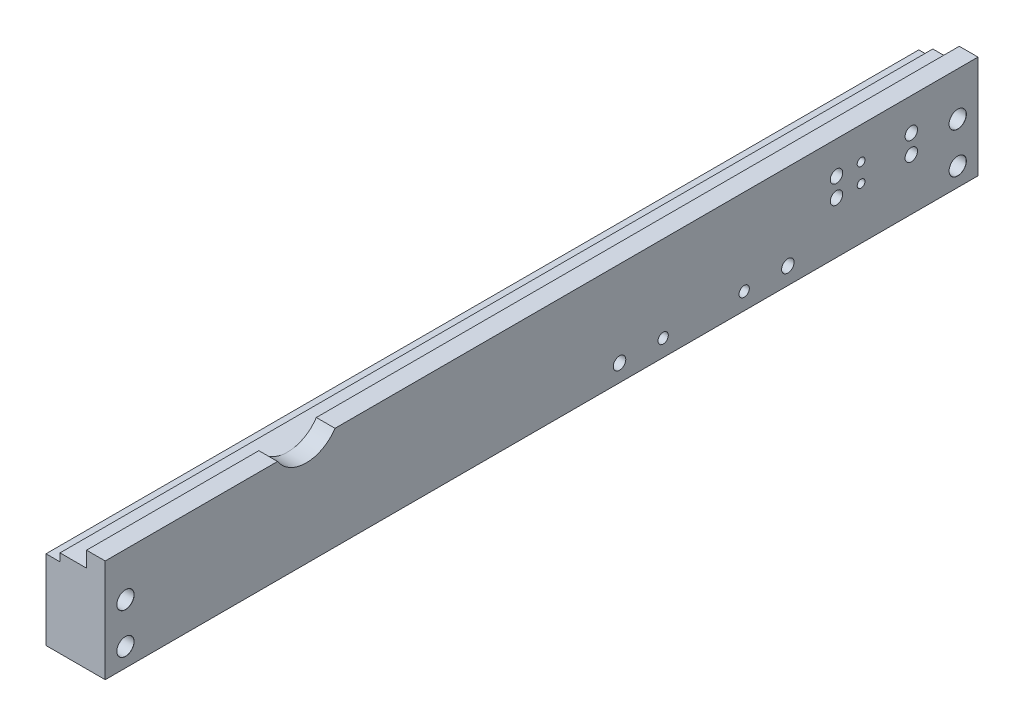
ISO-10303-21;
HEADER;
FILE_DESCRIPTION(('STEP AP214'),'2;1');
FILE_NAME('part.step','',(''),(''),'','','');
FILE_SCHEMA(('AUTOMOTIVE_DESIGN { 1 0 10303 214 1 1 1 1 }'));
ENDSEC;
DATA;
#1=APPLICATION_CONTEXT('core data for automotive mechanical design processes');
#2=APPLICATION_PROTOCOL_DEFINITION('international standard','automotive_design',2000,#1);
#3=PRODUCT_CONTEXT('',#1,'mechanical');
#4=PRODUCT('Part','Part','',(#3));
#5=PRODUCT_RELATED_PRODUCT_CATEGORY('part','',(#4));
#6=PRODUCT_DEFINITION_FORMATION('','',#4);
#7=PRODUCT_DEFINITION_CONTEXT('part definition',#1,'design');
#8=PRODUCT_DEFINITION('design','',#6,#7);
#9=PRODUCT_DEFINITION_SHAPE('','',#8);
#10=(LENGTH_UNIT() NAMED_UNIT(*) SI_UNIT(.MILLI.,.METRE.));
#11=(NAMED_UNIT(*) PLANE_ANGLE_UNIT() SI_UNIT($,.RADIAN.));
#12=(NAMED_UNIT(*) SI_UNIT($,.STERADIAN.) SOLID_ANGLE_UNIT());
#13=UNCERTAINTY_MEASURE_WITH_UNIT(LENGTH_MEASURE(1.E-05),#10,'distance_accuracy_value','');
#14=(GEOMETRIC_REPRESENTATION_CONTEXT(3) GLOBAL_UNCERTAINTY_ASSIGNED_CONTEXT((#13)) GLOBAL_UNIT_ASSIGNED_CONTEXT((#10,
#11,#12)) REPRESENTATION_CONTEXT('',''));
#15=CARTESIAN_POINT('',(0.,0.,0.));
#16=DIRECTION('',(0.,0.,1.));
#17=DIRECTION('',(1.,0.,0.));
#18=AXIS2_PLACEMENT_3D('',#15,#16,#17);
#19=CARTESIAN_POINT('',(-159.,251.054588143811,-280.));
#20=DIRECTION('',(0.,-1.,0.));
#21=DIRECTION('',(0.,0.,1.));
#22=AXIS2_PLACEMENT_3D('',#19,#20,#21);
#23=PLANE('',#22);
#24=DIRECTION('',(0.,0.,1.));
#25=VECTOR('',#24,1.);
#26=CARTESIAN_POINT('',(-165.,251.054588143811,-280.));
#27=LINE('',#26,#25);
#28=CARTESIAN_POINT('',(-165.,251.054588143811,-55.2804555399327));
#29=VERTEX_POINT('',#28);
#30=CARTESIAN_POINT('',(-165.,251.054588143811,0.));
#31=VERTEX_POINT('',#30);
#32=EDGE_CURVE('E164',#29,#31,#27,.T.);
#33=ORIENTED_EDGE('',*,*,#32,.T.);
#34=DIRECTION('',(-1.,0.,0.));
#35=VECTOR('',#34,1.);
#36=CARTESIAN_POINT('',(-159.,251.054588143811,0.));
#37=LINE('',#36,#35);
#38=CARTESIAN_POINT('',(-159.,251.054588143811,0.));
#39=VERTEX_POINT('',#38);
#40=EDGE_CURVE('E146',#39,#31,#37,.T.);
#41=ORIENTED_EDGE('',*,*,#40,.F.);
#42=DIRECTION('',(0.,0.,1.));
#43=VECTOR('',#42,1.);
#44=CARTESIAN_POINT('',(-159.,251.054588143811,-280.));
#45=LINE('',#44,#43);
#46=CARTESIAN_POINT('',(-159.,251.054588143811,-55.2804555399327));
#47=VERTEX_POINT('',#46);
#48=EDGE_CURVE('E24',#47,#39,#45,.T.);
#49=ORIENTED_EDGE('',*,*,#48,.F.);
#50=DIRECTION('',(1.,0.,0.));
#51=VECTOR('',#50,1.);
#52=CARTESIAN_POINT('',(-178.,251.054588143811,-55.2804555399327));
#53=LINE('',#52,#51);
#54=EDGE_CURVE('E110',#29,#47,#53,.T.);
#55=ORIENTED_EDGE('',*,*,#54,.F.);
#56=EDGE_LOOP('',(#33,#41,#49,#55));
#57=FACE_BOUND('',#56,.T.);
#58=ADVANCED_FACE('F16',(#57),#23,.F.);
#59=CARTESIAN_POINT('',(-165.,251.054588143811,-280.));
#60=DIRECTION('',(1.,0.,0.));
#61=DIRECTION('',(0.,0.,1.));
#62=AXIS2_PLACEMENT_3D('',#59,#60,#61);
#63=PLANE('',#62);
#64=CARTESIAN_POINT('',(-165.,251.054588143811,-280.));
#65=VERTEX_POINT('',#64);
#66=CARTESIAN_POINT('',(-165.,251.054588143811,-73.7195444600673));
#67=VERTEX_POINT('',#66);
#68=EDGE_CURVE('E103',#65,#67,#27,.T.);
#69=ORIENTED_EDGE('',*,*,#68,.F.);
#70=DIRECTION('',(0.,-1.,0.));
#71=VECTOR('',#70,1.);
#72=CARTESIAN_POINT('',(-165.,251.054588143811,-280.));
#73=LINE('',#72,#71);
#74=CARTESIAN_POINT('',(-165.,246.05458814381,-280.));
#75=VERTEX_POINT('',#74);
#76=EDGE_CURVE('E126',#65,#75,#73,.T.);
#77=ORIENTED_EDGE('',*,*,#76,.T.);
#78=DIRECTION('',(0.,0.,-1.));
#79=VECTOR('',#78,1.);
#80=CARTESIAN_POINT('',(-165.,246.05458814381,0.));
#81=LINE('',#80,#79);
#82=CARTESIAN_POINT('',(-165.,246.054588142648,-64.5));
#83=VERTEX_POINT('',#82);
#84=EDGE_CURVE('E200',#83,#75,#81,.T.);
#85=ORIENTED_EDGE('',*,*,#84,.F.);
#86=CARTESIAN_POINT('',(-165.,257.054588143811,-64.5));
#87=DIRECTION('',(-1.,0.,0.));
#88=DIRECTION('',(0.,0.,1.));
#89=AXIS2_PLACEMENT_3D('',#86,#87,#88);
#90=CIRCLE('',#89,11.0000000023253);
#91=EDGE_CURVE('E106',#67,#83,#90,.T.);
#92=ORIENTED_EDGE('',*,*,#91,.F.);
#93=EDGE_LOOP('',(#69,#77,#85,#92));
#94=FACE_BOUND('',#93,.T.);
#95=ADVANCED_FACE('F362',(#94),#63,.F.);
#96=CARTESIAN_POINT('',(-159.,218.05458814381,-280.));
#97=DIRECTION('',(-1.,0.,0.));
#98=DIRECTION('',(0.,0.,-1.));
#99=AXIS2_PLACEMENT_3D('',#96,#97,#98);
#100=PLANE('',#99);
#101=CARTESIAN_POINT('',(-159.,223.46553223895,-178.994628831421));
#102=DIRECTION('',(1.,0.,0.));
#103=DIRECTION('',(0.,0.,-1.));
#104=AXIS2_PLACEMENT_3D('',#101,#102,#103);
#105=CIRCLE('',#104,1.65);
#106=CARTESIAN_POINT('',(-159.,223.46553223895,-180.644628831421));
#107=VERTEX_POINT('',#106);
#108=EDGE_CURVE('E339',#107,#107,#105,.T.);
#109=ORIENTED_EDGE('',*,*,#108,.F.);
#110=EDGE_LOOP('',(#109));
#111=FACE_BOUND('',#110,.T.);
#112=CARTESIAN_POINT('',(-159.,223.46553223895,-204.994628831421));
#113=DIRECTION('',(1.,0.,0.));
#114=DIRECTION('',(0.,0.,-1.));
#115=AXIS2_PLACEMENT_3D('',#112,#113,#114);
#116=CIRCLE('',#115,1.65);
#117=CARTESIAN_POINT('',(-159.,223.46553223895,-206.644628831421));
#118=VERTEX_POINT('',#117);
#119=EDGE_CURVE('E333',#118,#118,#116,.T.);
#120=ORIENTED_EDGE('',*,*,#119,.F.);
#121=EDGE_LOOP('',(#120));
#122=FACE_BOUND('',#121,.T.);
#123=CARTESIAN_POINT('',(-159.,234.65458814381,-234.6));
#124=DIRECTION('',(1.,0.,0.));
#125=DIRECTION('',(0.,0.,-1.));
#126=AXIS2_PLACEMENT_3D('',#123,#124,#125);
#127=CIRCLE('',#126,2.);
#128=CARTESIAN_POINT('',(-159.,234.65458814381,-236.6));
#129=VERTEX_POINT('',#128);
#130=EDGE_CURVE('E327',#129,#129,#127,.T.);
#131=ORIENTED_EDGE('',*,*,#130,.F.);
#132=EDGE_LOOP('',(#131));
#133=FACE_BOUND('',#132,.T.);
#134=CARTESIAN_POINT('',(-159.,240.65458814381,-234.6));
#135=DIRECTION('',(1.,0.,0.));
#136=DIRECTION('',(0.,0.,-1.));
#137=AXIS2_PLACEMENT_3D('',#134,#135,#136);
#138=CIRCLE('',#137,2.);
#139=CARTESIAN_POINT('',(-159.,240.65458814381,-236.6));
#140=VERTEX_POINT('',#139);
#141=EDGE_CURVE('E321',#140,#140,#138,.T.);
#142=ORIENTED_EDGE('',*,*,#141,.F.);
#143=EDGE_LOOP('',(#142));
#144=FACE_BOUND('',#143,.T.);
#145=CARTESIAN_POINT('',(-159.,234.65458814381,-258.6));
#146=DIRECTION('',(1.,0.,0.));
#147=DIRECTION('',(0.,0.,-1.));
#148=AXIS2_PLACEMENT_3D('',#145,#146,#147);
#149=CIRCLE('',#148,2.);
#150=CARTESIAN_POINT('',(-159.,234.65458814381,-260.6));
#151=VERTEX_POINT('',#150);
#152=EDGE_CURVE('E315',#151,#151,#149,.T.);
#153=ORIENTED_EDGE('',*,*,#152,.F.);
#154=EDGE_LOOP('',(#153));
#155=FACE_BOUND('',#154,.T.);
#156=CARTESIAN_POINT('',(-159.,240.65458814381,-258.6));
#157=DIRECTION('',(1.,0.,0.));
#158=DIRECTION('',(0.,0.,-1.));
#159=AXIS2_PLACEMENT_3D('',#156,#157,#158);
#160=CIRCLE('',#159,2.);
#161=CARTESIAN_POINT('',(-159.,240.65458814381,-260.6));
#162=VERTEX_POINT('',#161);
#163=EDGE_CURVE('E309',#162,#162,#160,.T.);
#164=ORIENTED_EDGE('',*,*,#163,.F.);
#165=EDGE_LOOP('',(#164));
#166=FACE_BOUND('',#165,.T.);
#167=CARTESIAN_POINT('',(-159.,223.55458814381,-219.));
#168=DIRECTION('',(1.,0.,0.));
#169=DIRECTION('',(0.,0.,-1.));
#170=AXIS2_PLACEMENT_3D('',#167,#168,#169);
#171=CIRCLE('',#170,2.);
#172=CARTESIAN_POINT('',(-159.,223.55458814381,-221.));
#173=VERTEX_POINT('',#172);
#174=EDGE_CURVE('E303',#173,#173,#171,.T.);
#175=ORIENTED_EDGE('',*,*,#174,.F.);
#176=EDGE_LOOP('',(#175));
#177=FACE_BOUND('',#176,.T.);
#178=CARTESIAN_POINT('',(-159.,223.55458814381,-165.));
#179=DIRECTION('',(1.,0.,0.));
#180=DIRECTION('',(0.,0.,-1.));
#181=AXIS2_PLACEMENT_3D('',#178,#179,#180);
#182=CIRCLE('',#181,2.);
#183=CARTESIAN_POINT('',(-159.,223.55458814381,-167.));
#184=VERTEX_POINT('',#183);
#185=EDGE_CURVE('E297',#184,#184,#182,.T.);
#186=ORIENTED_EDGE('',*,*,#185,.F.);
#187=EDGE_LOOP('',(#186));
#188=FACE_BOUND('',#187,.T.);
#189=CARTESIAN_POINT('',(-159.,234.65458814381,-242.5));
#190=DIRECTION('',(1.,0.,0.));
#191=DIRECTION('',(0.,0.,-1.));
#192=AXIS2_PLACEMENT_3D('',#189,#190,#191);
#193=CIRCLE('',#192,1.25);
#194=CARTESIAN_POINT('',(-159.,234.65458814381,-243.75));
#195=VERTEX_POINT('',#194);
#196=EDGE_CURVE('E291',#195,#195,#193,.T.);
#197=ORIENTED_EDGE('',*,*,#196,.F.);
#198=EDGE_LOOP('',(#197));
#199=FACE_BOUND('',#198,.T.);
#200=CARTESIAN_POINT('',(-159.,240.65458814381,-242.5));
#201=DIRECTION('',(1.,0.,0.));
#202=DIRECTION('',(0.,0.,-1.));
#203=AXIS2_PLACEMENT_3D('',#200,#201,#202);
#204=CIRCLE('',#203,1.25);
#205=CARTESIAN_POINT('',(-159.,240.65458814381,-243.75));
#206=VERTEX_POINT('',#205);
#207=EDGE_CURVE('E114',#206,#206,#204,.T.);
#208=ORIENTED_EDGE('',*,*,#207,.F.);
#209=EDGE_LOOP('',(#208));
#210=FACE_BOUND('',#209,.T.);
#211=CARTESIAN_POINT('',(-159.,224.05458814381,-273.5));
#212=DIRECTION('',(1.,0.,0.));
#213=DIRECTION('',(0.,0.,-1.));
#214=AXIS2_PLACEMENT_3D('',#211,#212,#213);
#215=CIRCLE('',#214,2.775);
#216=CARTESIAN_POINT('',(-159.,224.05458814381,-276.275));
#217=VERTEX_POINT('',#216);
#218=EDGE_CURVE('E105',#217,#217,#215,.T.);
#219=ORIENTED_EDGE('',*,*,#218,.F.);
#220=EDGE_LOOP('',(#219));
#221=FACE_BOUND('',#220,.T.);
#222=CARTESIAN_POINT('',(-159.,237.05458814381,-273.5));
#223=DIRECTION('',(1.,0.,0.));
#224=DIRECTION('',(0.,0.,-1.));
#225=AXIS2_PLACEMENT_3D('',#222,#223,#224);
#226=CIRCLE('',#225,2.775);
#227=CARTESIAN_POINT('',(-159.,237.05458814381,-276.275));
#228=VERTEX_POINT('',#227);
#229=EDGE_CURVE('E261',#228,#228,#226,.T.);
#230=ORIENTED_EDGE('',*,*,#229,.F.);
#231=EDGE_LOOP('',(#230));
#232=FACE_BOUND('',#231,.T.);
#233=CARTESIAN_POINT('',(-159.,224.05458814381,-6.5));
#234=DIRECTION('',(1.,0.,0.));
#235=DIRECTION('',(0.,0.,-1.));
#236=AXIS2_PLACEMENT_3D('',#233,#234,#235);
#237=CIRCLE('',#236,2.775);
#238=CARTESIAN_POINT('',(-159.,224.05458814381,-9.275));
#239=VERTEX_POINT('',#238);
#240=EDGE_CURVE('E240',#239,#239,#237,.T.);
#241=ORIENTED_EDGE('',*,*,#240,.F.);
#242=EDGE_LOOP('',(#241));
#243=FACE_BOUND('',#242,.T.);
#244=CARTESIAN_POINT('',(-159.,237.05458814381,-6.5));
#245=DIRECTION('',(1.,0.,0.));
#246=DIRECTION('',(0.,0.,-1.));
#247=AXIS2_PLACEMENT_3D('',#244,#245,#246);
#248=CIRCLE('',#247,2.775);
#249=CARTESIAN_POINT('',(-159.,237.05458814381,-9.275));
#250=VERTEX_POINT('',#249);
#251=EDGE_CURVE('E219',#250,#250,#248,.T.);
#252=ORIENTED_EDGE('',*,*,#251,.F.);
#253=EDGE_LOOP('',(#252));
#254=FACE_BOUND('',#253,.T.);
#255=ORIENTED_EDGE('',*,*,#48,.T.);
#256=DIRECTION('',(0.,1.,0.));
#257=VECTOR('',#256,1.);
#258=CARTESIAN_POINT('',(-159.,218.05458814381,0.));
#259=LINE('',#258,#257);
#260=CARTESIAN_POINT('',(-159.,218.05458814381,0.));
#261=VERTEX_POINT('',#260);
#262=EDGE_CURVE('E144',#261,#39,#259,.T.);
#263=ORIENTED_EDGE('',*,*,#262,.F.);
#264=DIRECTION('',(0.,0.,1.));
#265=VECTOR('',#264,1.);
#266=CARTESIAN_POINT('',(-159.,218.05458814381,-280.));
#267=LINE('',#266,#265);
#268=CARTESIAN_POINT('',(-159.,218.05458814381,-280.));
#269=VERTEX_POINT('',#268);
#270=EDGE_CURVE('E121',#269,#261,#267,.T.);
#271=ORIENTED_EDGE('',*,*,#270,.F.);
#272=DIRECTION('',(0.,1.,0.));
#273=VECTOR('',#272,1.);
#274=CARTESIAN_POINT('',(-159.,218.05458814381,-280.));
#275=LINE('',#274,#273);
#276=CARTESIAN_POINT('',(-159.,251.054588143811,-280.));
#277=VERTEX_POINT('',#276);
#278=EDGE_CURVE('E118',#269,#277,#275,.T.);
#279=ORIENTED_EDGE('',*,*,#278,.T.);
#280=CARTESIAN_POINT('',(-159.,251.054588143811,-73.7195444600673));
#281=VERTEX_POINT('',#280);
#282=EDGE_CURVE('E11',#277,#281,#45,.T.);
#283=ORIENTED_EDGE('',*,*,#282,.T.);
#284=CARTESIAN_POINT('',(-159.,257.054588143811,-64.5));
#285=DIRECTION('',(-1.,0.,0.));
#286=DIRECTION('',(0.,0.,1.));
#287=AXIS2_PLACEMENT_3D('',#284,#285,#286);
#288=CIRCLE('',#287,11.0000000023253);
#289=EDGE_CURVE('E108',#281,#47,#288,.T.);
#290=ORIENTED_EDGE('',*,*,#289,.T.);
#291=EDGE_LOOP('',(#255,#263,#271,#279,#283,#290));
#292=FACE_BOUND('',#291,.T.);
#293=ADVANCED_FACE('F18',(#111,#122,#133,#144,#155,#166,#177,#188,#199,#210,#221,#232,#243,#254,
#292),#100,.F.);
#294=ORIENTED_EDGE('',*,*,#282,.F.);
#295=DIRECTION('',(-1.,0.,0.));
#296=VECTOR('',#295,1.);
#297=CARTESIAN_POINT('',(-159.,251.054588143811,-280.));
#298=LINE('',#297,#296);
#299=EDGE_CURVE('E123',#277,#65,#298,.T.);
#300=ORIENTED_EDGE('',*,*,#299,.T.);
#301=ORIENTED_EDGE('',*,*,#68,.T.);
#302=DIRECTION('',(1.,0.,0.));
#303=VECTOR('',#302,1.);
#304=CARTESIAN_POINT('',(-178.,251.054588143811,-73.7195444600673));
#305=LINE('',#304,#303);
#306=EDGE_CURVE('E98',#281,#67,#305,.F.);
#307=ORIENTED_EDGE('',*,*,#306,.F.);
#308=EDGE_LOOP('',(#294,#300,#301,#307));
#309=FACE_BOUND('',#308,.T.);
#310=ADVANCED_FACE('F100',(#309),#23,.F.);
#311=CARTESIAN_POINT('',(-165.,246.05458814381,0.));
#312=VERTEX_POINT('',#311);
#313=EDGE_CURVE('E131',#312,#83,#81,.T.);
#314=ORIENTED_EDGE('',*,*,#313,.F.);
#315=DIRECTION('',(0.,-1.,0.));
#316=VECTOR('',#315,1.);
#317=CARTESIAN_POINT('',(-165.,251.054588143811,0.));
#318=LINE('',#317,#316);
#319=EDGE_CURVE('E150',#31,#312,#318,.T.);
#320=ORIENTED_EDGE('',*,*,#319,.F.);
#321=ORIENTED_EDGE('',*,*,#32,.F.);
#322=EDGE_CURVE('E31',#83,#29,#90,.T.);
#323=ORIENTED_EDGE('',*,*,#322,.F.);
#324=EDGE_LOOP('',(#314,#320,#321,#323));
#325=FACE_BOUND('',#324,.T.);
#326=ADVANCED_FACE('F171',(#325),#63,.F.);
#327=CARTESIAN_POINT('',(-178.,243.55458814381,-280.));
#328=DIRECTION('',(0.,-1.,0.));
#329=DIRECTION('',(0.,0.,1.));
#330=AXIS2_PLACEMENT_3D('',#327,#328,#329);
#331=PLANE('',#330);
#332=DIRECTION('',(-1.,0.,0.));
#333=VECTOR('',#332,1.);
#334=CARTESIAN_POINT('',(-178.,243.55458814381,-280.));
#335=LINE('',#334,#333);
#336=CARTESIAN_POINT('',(-173.5,243.55458814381,-280.));
#337=VERTEX_POINT('',#336);
#338=CARTESIAN_POINT('',(-178.,243.55458814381,-280.));
#339=VERTEX_POINT('',#338);
#340=EDGE_CURVE('E136',#337,#339,#335,.T.);
#341=ORIENTED_EDGE('',*,*,#340,.T.);
#342=DIRECTION('',(0.,0.,1.));
#343=VECTOR('',#342,1.);
#344=CARTESIAN_POINT('',(-178.,243.55458814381,-280.));
#345=LINE('',#344,#343);
#346=CARTESIAN_POINT('',(-178.,243.55458814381,0.));
#347=VERTEX_POINT('',#346);
#348=EDGE_CURVE('E162',#339,#347,#345,.T.);
#349=ORIENTED_EDGE('',*,*,#348,.T.);
#350=DIRECTION('',(-1.,0.,0.));
#351=VECTOR('',#350,1.);
#352=CARTESIAN_POINT('',(-178.,243.55458814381,0.));
#353=LINE('',#352,#351);
#354=CARTESIAN_POINT('',(-173.5,243.55458814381,0.));
#355=VERTEX_POINT('',#354);
#356=EDGE_CURVE('E153',#355,#347,#353,.T.);
#357=ORIENTED_EDGE('',*,*,#356,.F.);
#358=DIRECTION('',(0.,0.,-1.));
#359=VECTOR('',#358,1.);
#360=CARTESIAN_POINT('',(-173.5,243.55458814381,0.));
#361=LINE('',#360,#359);
#362=EDGE_CURVE('E147',#355,#337,#361,.T.);
#363=ORIENTED_EDGE('',*,*,#362,.T.);
#364=EDGE_LOOP('',(#341,#349,#357,#363));
#365=FACE_BOUND('',#364,.T.);
#366=ADVANCED_FACE('F187',(#365),#331,.F.);
#367=CARTESIAN_POINT('',(-178.,218.05458814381,-280.));
#368=DIRECTION('',(1.,0.,0.));
#369=DIRECTION('',(0.,0.,1.));
#370=AXIS2_PLACEMENT_3D('',#367,#368,#369);
#371=PLANE('',#370);
#372=CARTESIAN_POINT('',(-178.,223.46553223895,-178.994628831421));
#373=DIRECTION('',(1.,0.,0.));
#374=DIRECTION('',(0.,0.,-1.));
#375=AXIS2_PLACEMENT_3D('',#372,#373,#374);
#376=CIRCLE('',#375,1.65);
#377=CARTESIAN_POINT('',(-178.,223.46553223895,-180.644628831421));
#378=VERTEX_POINT('',#377);
#379=EDGE_CURVE('E342',#378,#378,#376,.T.);
#380=ORIENTED_EDGE('',*,*,#379,.T.);
#381=EDGE_LOOP('',(#380));
#382=FACE_BOUND('',#381,.T.);
#383=CARTESIAN_POINT('',(-178.,223.46553223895,-204.994628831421));
#384=DIRECTION('',(1.,0.,0.));
#385=DIRECTION('',(0.,0.,-1.));
#386=AXIS2_PLACEMENT_3D('',#383,#384,#385);
#387=CIRCLE('',#386,1.65);
#388=CARTESIAN_POINT('',(-178.,223.46553223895,-206.644628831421));
#389=VERTEX_POINT('',#388);
#390=EDGE_CURVE('E336',#389,#389,#387,.T.);
#391=ORIENTED_EDGE('',*,*,#390,.T.);
#392=EDGE_LOOP('',(#391));
#393=FACE_BOUND('',#392,.T.);
#394=CARTESIAN_POINT('',(-178.,234.65458814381,-234.6));
#395=DIRECTION('',(1.,0.,0.));
#396=DIRECTION('',(0.,0.,-1.));
#397=AXIS2_PLACEMENT_3D('',#394,#395,#396);
#398=CIRCLE('',#397,2.);
#399=CARTESIAN_POINT('',(-178.,234.65458814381,-236.6));
#400=VERTEX_POINT('',#399);
#401=EDGE_CURVE('E330',#400,#400,#398,.T.);
#402=ORIENTED_EDGE('',*,*,#401,.T.);
#403=EDGE_LOOP('',(#402));
#404=FACE_BOUND('',#403,.T.);
#405=CARTESIAN_POINT('',(-178.,240.65458814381,-234.6));
#406=DIRECTION('',(1.,0.,0.));
#407=DIRECTION('',(0.,0.,-1.));
#408=AXIS2_PLACEMENT_3D('',#405,#406,#407);
#409=CIRCLE('',#408,2.);
#410=CARTESIAN_POINT('',(-178.,240.65458814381,-236.6));
#411=VERTEX_POINT('',#410);
#412=EDGE_CURVE('E324',#411,#411,#409,.T.);
#413=ORIENTED_EDGE('',*,*,#412,.T.);
#414=EDGE_LOOP('',(#413));
#415=FACE_BOUND('',#414,.T.);
#416=CARTESIAN_POINT('',(-178.,234.65458814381,-258.6));
#417=DIRECTION('',(1.,0.,0.));
#418=DIRECTION('',(0.,0.,-1.));
#419=AXIS2_PLACEMENT_3D('',#416,#417,#418);
#420=CIRCLE('',#419,2.);
#421=CARTESIAN_POINT('',(-178.,234.65458814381,-260.6));
#422=VERTEX_POINT('',#421);
#423=EDGE_CURVE('E318',#422,#422,#420,.T.);
#424=ORIENTED_EDGE('',*,*,#423,.T.);
#425=EDGE_LOOP('',(#424));
#426=FACE_BOUND('',#425,.T.);
#427=CARTESIAN_POINT('',(-178.,240.65458814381,-258.6));
#428=DIRECTION('',(1.,0.,0.));
#429=DIRECTION('',(0.,0.,-1.));
#430=AXIS2_PLACEMENT_3D('',#427,#428,#429);
#431=CIRCLE('',#430,1.99999999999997);
#432=CARTESIAN_POINT('',(-178.,240.65458814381,-260.6));
#433=VERTEX_POINT('',#432);
#434=EDGE_CURVE('E312',#433,#433,#431,.T.);
#435=ORIENTED_EDGE('',*,*,#434,.T.);
#436=EDGE_LOOP('',(#435));
#437=FACE_BOUND('',#436,.T.);
#438=CARTESIAN_POINT('',(-178.,223.55458814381,-219.));
#439=DIRECTION('',(1.,0.,0.));
#440=DIRECTION('',(0.,0.,-1.));
#441=AXIS2_PLACEMENT_3D('',#438,#439,#440);
#442=CIRCLE('',#441,2.);
#443=CARTESIAN_POINT('',(-178.,223.55458814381,-221.));
#444=VERTEX_POINT('',#443);
#445=EDGE_CURVE('E306',#444,#444,#442,.T.);
#446=ORIENTED_EDGE('',*,*,#445,.T.);
#447=EDGE_LOOP('',(#446));
#448=FACE_BOUND('',#447,.T.);
#449=CARTESIAN_POINT('',(-178.,223.55458814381,-165.));
#450=DIRECTION('',(1.,0.,0.));
#451=DIRECTION('',(0.,0.,-1.));
#452=AXIS2_PLACEMENT_3D('',#449,#450,#451);
#453=CIRCLE('',#452,2.);
#454=CARTESIAN_POINT('',(-178.,223.55458814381,-167.));
#455=VERTEX_POINT('',#454);
#456=EDGE_CURVE('E300',#455,#455,#453,.T.);
#457=ORIENTED_EDGE('',*,*,#456,.T.);
#458=EDGE_LOOP('',(#457));
#459=FACE_BOUND('',#458,.T.);
#460=CARTESIAN_POINT('',(-178.,234.65458814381,-242.5));
#461=DIRECTION('',(1.,0.,0.));
#462=DIRECTION('',(0.,0.,-1.));
#463=AXIS2_PLACEMENT_3D('',#460,#461,#462);
#464=CIRCLE('',#463,1.24999999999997);
#465=CARTESIAN_POINT('',(-178.,234.65458814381,-243.75));
#466=VERTEX_POINT('',#465);
#467=EDGE_CURVE('E294',#466,#466,#464,.T.);
#468=ORIENTED_EDGE('',*,*,#467,.T.);
#469=EDGE_LOOP('',(#468));
#470=FACE_BOUND('',#469,.T.);
#471=CARTESIAN_POINT('',(-178.,240.65458814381,-242.5));
#472=DIRECTION('',(1.,0.,0.));
#473=DIRECTION('',(0.,0.,-1.));
#474=AXIS2_PLACEMENT_3D('',#471,#472,#473);
#475=CIRCLE('',#474,1.24999999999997);
#476=CARTESIAN_POINT('',(-178.,240.65458814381,-243.75));
#477=VERTEX_POINT('',#476);
#478=EDGE_CURVE('E288',#477,#477,#475,.T.);
#479=ORIENTED_EDGE('',*,*,#478,.T.);
#480=EDGE_LOOP('',(#479));
#481=FACE_BOUND('',#480,.T.);
#482=CARTESIAN_POINT('',(-178.,224.05458814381,-273.5));
#483=DIRECTION('',(1.,0.,0.));
#484=DIRECTION('',(0.,0.,-1.));
#485=AXIS2_PLACEMENT_3D('',#482,#483,#484);
#486=CIRCLE('',#485,5.025);
#487=CARTESIAN_POINT('',(-178.,224.05458814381,-278.525));
#488=VERTEX_POINT('',#487);
#489=EDGE_CURVE('E279',#488,#488,#486,.T.);
#490=ORIENTED_EDGE('',*,*,#489,.T.);
#491=EDGE_LOOP('',(#490));
#492=FACE_BOUND('',#491,.T.);
#493=CARTESIAN_POINT('',(-178.,237.05458814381,-273.5));
#494=DIRECTION('',(1.,0.,0.));
#495=DIRECTION('',(0.,0.,-1.));
#496=AXIS2_PLACEMENT_3D('',#493,#494,#495);
#497=CIRCLE('',#496,5.025);
#498=CARTESIAN_POINT('',(-178.,237.05458814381,-278.525));
#499=VERTEX_POINT('',#498);
#500=EDGE_CURVE('E258',#499,#499,#497,.T.);
#501=ORIENTED_EDGE('',*,*,#500,.T.);
#502=EDGE_LOOP('',(#501));
#503=FACE_BOUND('',#502,.T.);
#504=CARTESIAN_POINT('',(-178.,224.05458814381,-6.5));
#505=DIRECTION('',(1.,0.,0.));
#506=DIRECTION('',(0.,0.,-1.));
#507=AXIS2_PLACEMENT_3D('',#504,#505,#506);
#508=CIRCLE('',#507,5.025);
#509=CARTESIAN_POINT('',(-178.,224.05458814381,-11.525));
#510=VERTEX_POINT('',#509);
#511=EDGE_CURVE('E237',#510,#510,#508,.T.);
#512=ORIENTED_EDGE('',*,*,#511,.T.);
#513=EDGE_LOOP('',(#512));
#514=FACE_BOUND('',#513,.T.);
#515=CARTESIAN_POINT('',(-178.,237.05458814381,-6.5));
#516=DIRECTION('',(1.,0.,0.));
#517=DIRECTION('',(0.,0.,-1.));
#518=AXIS2_PLACEMENT_3D('',#515,#516,#517);
#519=CIRCLE('',#518,5.025);
#520=CARTESIAN_POINT('',(-178.,237.05458814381,-11.525));
#521=VERTEX_POINT('',#520);
#522=EDGE_CURVE('E216',#521,#521,#519,.T.);
#523=ORIENTED_EDGE('',*,*,#522,.T.);
#524=EDGE_LOOP('',(#523));
#525=FACE_BOUND('',#524,.T.);
#526=DIRECTION('',(0.,-1.,0.));
#527=VECTOR('',#526,1.);
#528=CARTESIAN_POINT('',(-178.,218.05458814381,0.));
#529=LINE('',#528,#527);
#530=CARTESIAN_POINT('',(-178.,218.05458814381,0.));
#531=VERTEX_POINT('',#530);
#532=EDGE_CURVE('E128',#347,#531,#529,.T.);
#533=ORIENTED_EDGE('',*,*,#532,.F.);
#534=ORIENTED_EDGE('',*,*,#348,.F.);
#535=DIRECTION('',(0.,-1.,0.));
#536=VECTOR('',#535,1.);
#537=CARTESIAN_POINT('',(-178.,218.05458814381,-280.));
#538=LINE('',#537,#536);
#539=CARTESIAN_POINT('',(-178.,218.05458814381,-280.));
#540=VERTEX_POINT('',#539);
#541=EDGE_CURVE('E139',#339,#540,#538,.T.);
#542=ORIENTED_EDGE('',*,*,#541,.T.);
#543=DIRECTION('',(0.,0.,1.));
#544=VECTOR('',#543,1.);
#545=CARTESIAN_POINT('',(-178.,218.05458814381,-280.));
#546=LINE('',#545,#544);
#547=EDGE_CURVE('E159',#540,#531,#546,.T.);
#548=ORIENTED_EDGE('',*,*,#547,.T.);
#549=EDGE_LOOP('',(#533,#534,#542,#548));
#550=FACE_BOUND('',#549,.T.);
#551=ADVANCED_FACE('F184',(#382,#393,#404,#415,#426,#437,#448,#459,#470,#481,#492,#503,#514,
#525,#550),#371,.F.);
#552=CARTESIAN_POINT('',(-159.,218.05458814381,-280.));
#553=DIRECTION('',(0.,1.,0.));
#554=DIRECTION('',(0.,0.,-1.));
#555=AXIS2_PLACEMENT_3D('',#552,#553,#554);
#556=PLANE('',#555);
#557=DIRECTION('',(1.,0.,0.));
#558=VECTOR('',#557,1.);
#559=CARTESIAN_POINT('',(-159.,218.05458814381,0.));
#560=LINE('',#559,#558);
#561=EDGE_CURVE('E124',#531,#261,#560,.T.);
#562=ORIENTED_EDGE('',*,*,#561,.F.);
#563=ORIENTED_EDGE('',*,*,#547,.F.);
#564=DIRECTION('',(1.,0.,0.));
#565=VECTOR('',#564,1.);
#566=CARTESIAN_POINT('',(-159.,218.05458814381,-280.));
#567=LINE('',#566,#565);
#568=EDGE_CURVE('E142',#540,#269,#567,.T.);
#569=ORIENTED_EDGE('',*,*,#568,.T.);
#570=ORIENTED_EDGE('',*,*,#270,.T.);
#571=EDGE_LOOP('',(#562,#563,#569,#570));
#572=FACE_BOUND('',#571,.T.);
#573=ADVANCED_FACE('F178',(#572),#556,.F.);
#574=CARTESIAN_POINT('',(0.,0.,-280.));
#575=DIRECTION('',(0.,0.,-1.));
#576=DIRECTION('',(1.,0.,0.));
#577=AXIS2_PLACEMENT_3D('',#574,#575,#576);
#578=PLANE('',#577);
#579=ORIENTED_EDGE('',*,*,#76,.F.);
#580=ORIENTED_EDGE('',*,*,#299,.F.);
#581=ORIENTED_EDGE('',*,*,#278,.F.);
#582=ORIENTED_EDGE('',*,*,#568,.F.);
#583=ORIENTED_EDGE('',*,*,#541,.F.);
#584=ORIENTED_EDGE('',*,*,#340,.F.);
#585=DIRECTION('',(0.,-1.,0.));
#586=VECTOR('',#585,1.);
#587=CARTESIAN_POINT('',(-173.5,243.55458814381,-280.));
#588=LINE('',#587,#586);
#589=CARTESIAN_POINT('',(-173.5,246.05458814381,-280.));
#590=VERTEX_POINT('',#589);
#591=EDGE_CURVE('E39',#590,#337,#588,.T.);
#592=ORIENTED_EDGE('',*,*,#591,.F.);
#593=DIRECTION('',(-1.,0.,0.));
#594=VECTOR('',#593,1.);
#595=CARTESIAN_POINT('',(-165.,246.05458814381,-280.));
#596=LINE('',#595,#594);
#597=EDGE_CURVE('E194',#75,#590,#596,.T.);
#598=ORIENTED_EDGE('',*,*,#597,.F.);
#599=EDGE_LOOP('',(#579,#580,#581,#582,#583,#584,#592,#598));
#600=FACE_BOUND('',#599,.T.);
#601=ADVANCED_FACE('F180',(#600),#578,.T.);
#602=CARTESIAN_POINT('',(0.,0.,0.));
#603=DIRECTION('',(0.,0.,-1.));
#604=DIRECTION('',(1.,0.,0.));
#605=AXIS2_PLACEMENT_3D('',#602,#603,#604);
#606=PLANE('',#605);
#607=DIRECTION('',(-1.,0.,0.));
#608=VECTOR('',#607,1.);
#609=CARTESIAN_POINT('',(-165.,246.05458814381,0.));
#610=LINE('',#609,#608);
#611=CARTESIAN_POINT('',(-173.5,246.05458814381,0.));
#612=VERTEX_POINT('',#611);
#613=EDGE_CURVE('E193',#312,#612,#610,.T.);
#614=ORIENTED_EDGE('',*,*,#613,.T.);
#615=DIRECTION('',(0.,-1.,0.));
#616=VECTOR('',#615,1.);
#617=CARTESIAN_POINT('',(-173.5,243.55458814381,0.));
#618=LINE('',#617,#616);
#619=EDGE_CURVE('E198',#612,#355,#618,.T.);
#620=ORIENTED_EDGE('',*,*,#619,.T.);
#621=ORIENTED_EDGE('',*,*,#356,.T.);
#622=ORIENTED_EDGE('',*,*,#532,.T.);
#623=ORIENTED_EDGE('',*,*,#561,.T.);
#624=ORIENTED_EDGE('',*,*,#262,.T.);
#625=ORIENTED_EDGE('',*,*,#40,.T.);
#626=ORIENTED_EDGE('',*,*,#319,.T.);
#627=EDGE_LOOP('',(#614,#620,#621,#622,#623,#624,#625,#626));
#628=FACE_BOUND('',#627,.T.);
#629=ADVANCED_FACE('F175',(#628),#606,.F.);
#630=CARTESIAN_POINT('',(-173.5,243.55458814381,0.));
#631=DIRECTION('',(-1.,0.,0.));
#632=DIRECTION('',(0.,0.,-1.));
#633=AXIS2_PLACEMENT_3D('',#630,#631,#632);
#634=PLANE('',#633);
#635=ORIENTED_EDGE('',*,*,#591,.T.);
#636=ORIENTED_EDGE('',*,*,#362,.F.);
#637=ORIENTED_EDGE('',*,*,#619,.F.);
#638=DIRECTION('',(0.,0.,-1.));
#639=VECTOR('',#638,1.);
#640=CARTESIAN_POINT('',(-173.5,246.05458814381,0.));
#641=LINE('',#640,#639);
#642=EDGE_CURVE('E189',#612,#590,#641,.T.);
#643=ORIENTED_EDGE('',*,*,#642,.T.);
#644=EDGE_LOOP('',(#635,#636,#637,#643));
#645=FACE_BOUND('',#644,.T.);
#646=ADVANCED_FACE('F457',(#645),#634,.T.);
#647=CARTESIAN_POINT('',(-165.,246.05458814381,0.));
#648=DIRECTION('',(0.,1.,0.));
#649=DIRECTION('',(0.,0.,-1.));
#650=AXIS2_PLACEMENT_3D('',#647,#648,#649);
#651=PLANE('',#650);
#652=ORIENTED_EDGE('',*,*,#84,.T.);
#653=ORIENTED_EDGE('',*,*,#597,.T.);
#654=ORIENTED_EDGE('',*,*,#642,.F.);
#655=ORIENTED_EDGE('',*,*,#613,.F.);
#656=ORIENTED_EDGE('',*,*,#313,.T.);
#657=EDGE_LOOP('',(#652,#653,#654,#655,#656));
#658=FACE_BOUND('',#657,.T.);
#659=ADVANCED_FACE('F411',(#658),#651,.T.);
#660=CARTESIAN_POINT('',(-159.025,237.05458814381,-6.5));
#661=DIRECTION('',(1.,0.,0.));
#662=DIRECTION('',(0.,0.,1.));
#663=AXIS2_PLACEMENT_3D('',#660,#661,#662);
#664=CONICAL_SURFACE('',#663,2.75,0.785398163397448);
#665=ORIENTED_EDGE('',*,*,#251,.T.);
#666=EDGE_LOOP('',(#665));
#667=FACE_BOUND('',#666,.T.);
#668=CARTESIAN_POINT('',(-159.025,237.05458814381,-6.5));
#669=DIRECTION('',(1.,0.,0.));
#670=DIRECTION('',(0.,0.,-1.));
#671=AXIS2_PLACEMENT_3D('',#668,#669,#670);
#672=CIRCLE('',#671,2.75);
#673=CARTESIAN_POINT('',(-159.025,237.05458814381,-9.25));
#674=VERTEX_POINT('',#673);
#675=EDGE_CURVE('E197',#674,#674,#672,.T.);
#676=ORIENTED_EDGE('',*,*,#675,.F.);
#677=EDGE_LOOP('',(#676));
#678=FACE_BOUND('',#677,.T.);
#679=ADVANCED_FACE('F407',(#667,#678),#664,.F.);
#680=CARTESIAN_POINT('',(-178.,237.05458814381,-6.5));
#681=DIRECTION('',(-1.,0.,0.));
#682=DIRECTION('',(0.,0.,-1.));
#683=AXIS2_PLACEMENT_3D('',#680,#681,#682);
#684=CYLINDRICAL_SURFACE('',#683,2.75);
#685=ORIENTED_EDGE('',*,*,#675,.T.);
#686=EDGE_LOOP('',(#685));
#687=FACE_BOUND('',#686,.T.);
#688=CARTESIAN_POINT('',(-172.275,237.05458814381,-6.5));
#689=DIRECTION('',(1.,0.,0.));
#690=DIRECTION('',(0.,0.,-1.));
#691=AXIS2_PLACEMENT_3D('',#688,#689,#690);
#692=CIRCLE('',#691,2.75);
#693=CARTESIAN_POINT('',(-172.275,237.05458814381,-9.25));
#694=VERTEX_POINT('',#693);
#695=EDGE_CURVE('E204',#694,#694,#692,.T.);
#696=ORIENTED_EDGE('',*,*,#695,.F.);
#697=EDGE_LOOP('',(#696));
#698=FACE_BOUND('',#697,.T.);
#699=ADVANCED_FACE('F410',(#687,#698),#684,.F.);
#700=CARTESIAN_POINT('',(-172.3,237.05458814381,-6.5));
#701=DIRECTION('',(-1.,0.,0.));
#702=DIRECTION('',(0.,0.,-1.));
#703=AXIS2_PLACEMENT_3D('',#700,#701,#702);
#704=CONICAL_SURFACE('',#703,2.775,0.785398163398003);
#705=ORIENTED_EDGE('',*,*,#695,.T.);
#706=EDGE_LOOP('',(#705));
#707=FACE_BOUND('',#706,.T.);
#708=CARTESIAN_POINT('',(-172.3,237.05458814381,-6.5));
#709=DIRECTION('',(1.,0.,0.));
#710=DIRECTION('',(0.,0.,-1.));
#711=AXIS2_PLACEMENT_3D('',#708,#709,#710);
#712=CIRCLE('',#711,2.775);
#713=CARTESIAN_POINT('',(-172.3,237.05458814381,-9.275));
#714=VERTEX_POINT('',#713);
#715=EDGE_CURVE('E207',#714,#714,#712,.T.);
#716=ORIENTED_EDGE('',*,*,#715,.F.);
#717=EDGE_LOOP('',(#716));
#718=FACE_BOUND('',#717,.T.);
#719=ADVANCED_FACE('F417',(#707,#718),#704,.F.);
#720=CARTESIAN_POINT('',(-172.3,239.82958814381,-6.5));
#721=DIRECTION('',(1.,0.,0.));
#722=DIRECTION('',(0.,0.,1.));
#723=AXIS2_PLACEMENT_3D('',#720,#721,#722);
#724=PLANE('',#723);
#725=ORIENTED_EDGE('',*,*,#715,.T.);
#726=EDGE_LOOP('',(#725));
#727=FACE_BOUND('',#726,.T.);
#728=CARTESIAN_POINT('',(-172.3,237.05458814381,-6.5));
#729=DIRECTION('',(1.,0.,0.));
#730=DIRECTION('',(0.,0.,-1.));
#731=AXIS2_PLACEMENT_3D('',#728,#729,#730);
#732=CIRCLE('',#731,5.);
#733=CARTESIAN_POINT('',(-172.3,237.05458814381,-11.5));
#734=VERTEX_POINT('',#733);
#735=EDGE_CURVE('E210',#734,#734,#732,.T.);
#736=ORIENTED_EDGE('',*,*,#735,.F.);
#737=EDGE_LOOP('',(#736));
#738=FACE_BOUND('',#737,.T.);
#739=ADVANCED_FACE('F423',(#727,#738),#724,.F.);
#740=CARTESIAN_POINT('',(-178.,237.05458814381,-6.5));
#741=DIRECTION('',(-1.,0.,0.));
#742=DIRECTION('',(0.,0.,-1.));
#743=AXIS2_PLACEMENT_3D('',#740,#741,#742);
#744=CYLINDRICAL_SURFACE('',#743,5.);
#745=ORIENTED_EDGE('',*,*,#735,.T.);
#746=EDGE_LOOP('',(#745));
#747=FACE_BOUND('',#746,.T.);
#748=CARTESIAN_POINT('',(-177.975,237.05458814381,-6.5));
#749=DIRECTION('',(1.,0.,0.));
#750=DIRECTION('',(0.,0.,-1.));
#751=AXIS2_PLACEMENT_3D('',#748,#749,#750);
#752=CIRCLE('',#751,5.);
#753=CARTESIAN_POINT('',(-177.975,237.05458814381,-11.5));
#754=VERTEX_POINT('',#753);
#755=EDGE_CURVE('E213',#754,#754,#752,.T.);
#756=ORIENTED_EDGE('',*,*,#755,.F.);
#757=EDGE_LOOP('',(#756));
#758=FACE_BOUND('',#757,.T.);
#759=ADVANCED_FACE('F429',(#747,#758),#744,.F.);
#760=CARTESIAN_POINT('',(-178.,237.05458814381,-6.5));
#761=DIRECTION('',(-1.,0.,0.));
#762=DIRECTION('',(0.,0.,-1.));
#763=AXIS2_PLACEMENT_3D('',#760,#761,#762);
#764=CONICAL_SURFACE('',#763,5.025,0.785398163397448);
#765=ORIENTED_EDGE('',*,*,#755,.T.);
#766=EDGE_LOOP('',(#765));
#767=FACE_BOUND('',#766,.T.);
#768=ORIENTED_EDGE('',*,*,#522,.F.);
#769=EDGE_LOOP('',(#768));
#770=FACE_BOUND('',#769,.T.);
#771=ADVANCED_FACE('F435',(#767,#770),#764,.F.);
#772=CARTESIAN_POINT('',(-159.025,224.05458814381,-6.5));
#773=DIRECTION('',(1.,0.,0.));
#774=DIRECTION('',(0.,0.,1.));
#775=AXIS2_PLACEMENT_3D('',#772,#773,#774);
#776=CONICAL_SURFACE('',#775,2.75,0.785398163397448);
#777=ORIENTED_EDGE('',*,*,#240,.T.);
#778=EDGE_LOOP('',(#777));
#779=FACE_BOUND('',#778,.T.);
#780=CARTESIAN_POINT('',(-159.025,224.05458814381,-6.5));
#781=DIRECTION('',(1.,0.,0.));
#782=DIRECTION('',(0.,0.,-1.));
#783=AXIS2_PLACEMENT_3D('',#780,#781,#782);
#784=CIRCLE('',#783,2.75);
#785=CARTESIAN_POINT('',(-159.025,224.05458814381,-9.25));
#786=VERTEX_POINT('',#785);
#787=EDGE_CURVE('E222',#786,#786,#784,.T.);
#788=ORIENTED_EDGE('',*,*,#787,.F.);
#789=EDGE_LOOP('',(#788));
#790=FACE_BOUND('',#789,.T.);
#791=ADVANCED_FACE('F441',(#779,#790),#776,.F.);
#792=CARTESIAN_POINT('',(-178.,224.05458814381,-6.5));
#793=DIRECTION('',(-1.,0.,0.));
#794=DIRECTION('',(0.,0.,-1.));
#795=AXIS2_PLACEMENT_3D('',#792,#793,#794);
#796=CYLINDRICAL_SURFACE('',#795,2.75);
#797=ORIENTED_EDGE('',*,*,#787,.T.);
#798=EDGE_LOOP('',(#797));
#799=FACE_BOUND('',#798,.T.);
#800=CARTESIAN_POINT('',(-172.275,224.05458814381,-6.5));
#801=DIRECTION('',(1.,0.,0.));
#802=DIRECTION('',(0.,0.,-1.));
#803=AXIS2_PLACEMENT_3D('',#800,#801,#802);
#804=CIRCLE('',#803,2.75);
#805=CARTESIAN_POINT('',(-172.275,224.05458814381,-9.25));
#806=VERTEX_POINT('',#805);
#807=EDGE_CURVE('E225',#806,#806,#804,.T.);
#808=ORIENTED_EDGE('',*,*,#807,.F.);
#809=EDGE_LOOP('',(#808));
#810=FACE_BOUND('',#809,.T.);
#811=ADVANCED_FACE('F467',(#799,#810),#796,.F.);
#812=CARTESIAN_POINT('',(-172.3,224.05458814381,-6.5));
#813=DIRECTION('',(-1.,0.,0.));
#814=DIRECTION('',(0.,0.,-1.));
#815=AXIS2_PLACEMENT_3D('',#812,#813,#814);
#816=CONICAL_SURFACE('',#815,2.775,0.785398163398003);
#817=ORIENTED_EDGE('',*,*,#807,.T.);
#818=EDGE_LOOP('',(#817));
#819=FACE_BOUND('',#818,.T.);
#820=CARTESIAN_POINT('',(-172.3,224.05458814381,-6.5));
#821=DIRECTION('',(1.,0.,0.));
#822=DIRECTION('',(0.,0.,-1.));
#823=AXIS2_PLACEMENT_3D('',#820,#821,#822);
#824=CIRCLE('',#823,2.775);
#825=CARTESIAN_POINT('',(-172.3,224.05458814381,-9.275));
#826=VERTEX_POINT('',#825);
#827=EDGE_CURVE('E228',#826,#826,#824,.T.);
#828=ORIENTED_EDGE('',*,*,#827,.F.);
#829=EDGE_LOOP('',(#828));
#830=FACE_BOUND('',#829,.T.);
#831=ADVANCED_FACE('F471',(#819,#830),#816,.F.);
#832=CARTESIAN_POINT('',(-172.3,226.82958814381,-6.5));
#833=DIRECTION('',(1.,0.,0.));
#834=DIRECTION('',(0.,0.,1.));
#835=AXIS2_PLACEMENT_3D('',#832,#833,#834);
#836=PLANE('',#835);
#837=ORIENTED_EDGE('',*,*,#827,.T.);
#838=EDGE_LOOP('',(#837));
#839=FACE_BOUND('',#838,.T.);
#840=CARTESIAN_POINT('',(-172.3,224.05458814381,-6.5));
#841=DIRECTION('',(1.,0.,0.));
#842=DIRECTION('',(0.,0.,-1.));
#843=AXIS2_PLACEMENT_3D('',#840,#841,#842);
#844=CIRCLE('',#843,5.);
#845=CARTESIAN_POINT('',(-172.3,224.05458814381,-11.5));
#846=VERTEX_POINT('',#845);
#847=EDGE_CURVE('E231',#846,#846,#844,.T.);
#848=ORIENTED_EDGE('',*,*,#847,.F.);
#849=EDGE_LOOP('',(#848));
#850=FACE_BOUND('',#849,.T.);
#851=ADVANCED_FACE('F475',(#839,#850),#836,.F.);
#852=CARTESIAN_POINT('',(-178.,224.05458814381,-6.5));
#853=DIRECTION('',(-1.,0.,0.));
#854=DIRECTION('',(0.,0.,-1.));
#855=AXIS2_PLACEMENT_3D('',#852,#853,#854);
#856=CYLINDRICAL_SURFACE('',#855,5.);
#857=ORIENTED_EDGE('',*,*,#847,.T.);
#858=EDGE_LOOP('',(#857));
#859=FACE_BOUND('',#858,.T.);
#860=CARTESIAN_POINT('',(-177.975,224.05458814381,-6.5));
#861=DIRECTION('',(1.,0.,0.));
#862=DIRECTION('',(0.,0.,-1.));
#863=AXIS2_PLACEMENT_3D('',#860,#861,#862);
#864=CIRCLE('',#863,5.);
#865=CARTESIAN_POINT('',(-177.975,224.05458814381,-11.5));
#866=VERTEX_POINT('',#865);
#867=EDGE_CURVE('E234',#866,#866,#864,.T.);
#868=ORIENTED_EDGE('',*,*,#867,.F.);
#869=EDGE_LOOP('',(#868));
#870=FACE_BOUND('',#869,.T.);
#871=ADVANCED_FACE('F479',(#859,#870),#856,.F.);
#872=CARTESIAN_POINT('',(-178.,224.05458814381,-6.5));
#873=DIRECTION('',(-1.,0.,0.));
#874=DIRECTION('',(0.,0.,-1.));
#875=AXIS2_PLACEMENT_3D('',#872,#873,#874);
#876=CONICAL_SURFACE('',#875,5.025,0.785398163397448);
#877=ORIENTED_EDGE('',*,*,#867,.T.);
#878=EDGE_LOOP('',(#877));
#879=FACE_BOUND('',#878,.T.);
#880=ORIENTED_EDGE('',*,*,#511,.F.);
#881=EDGE_LOOP('',(#880));
#882=FACE_BOUND('',#881,.T.);
#883=ADVANCED_FACE('F483',(#879,#882),#876,.F.);
#884=CARTESIAN_POINT('',(-159.025,237.05458814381,-273.5));
#885=DIRECTION('',(1.,0.,0.));
#886=DIRECTION('',(0.,0.,1.));
#887=AXIS2_PLACEMENT_3D('',#884,#885,#886);
#888=CONICAL_SURFACE('',#887,2.75,0.785398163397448);
#889=ORIENTED_EDGE('',*,*,#229,.T.);
#890=EDGE_LOOP('',(#889));
#891=FACE_BOUND('',#890,.T.);
#892=CARTESIAN_POINT('',(-159.025,237.05458814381,-273.5));
#893=DIRECTION('',(1.,0.,0.));
#894=DIRECTION('',(0.,0.,-1.));
#895=AXIS2_PLACEMENT_3D('',#892,#893,#894);
#896=CIRCLE('',#895,2.75);
#897=CARTESIAN_POINT('',(-159.025,237.05458814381,-276.25));
#898=VERTEX_POINT('',#897);
#899=EDGE_CURVE('E243',#898,#898,#896,.T.);
#900=ORIENTED_EDGE('',*,*,#899,.F.);
#901=EDGE_LOOP('',(#900));
#902=FACE_BOUND('',#901,.T.);
#903=ADVANCED_FACE('F487',(#891,#902),#888,.F.);
#904=CARTESIAN_POINT('',(-178.,237.05458814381,-273.5));
#905=DIRECTION('',(-1.,0.,0.));
#906=DIRECTION('',(0.,0.,-1.));
#907=AXIS2_PLACEMENT_3D('',#904,#905,#906);
#908=CYLINDRICAL_SURFACE('',#907,2.75);
#909=ORIENTED_EDGE('',*,*,#899,.T.);
#910=EDGE_LOOP('',(#909));
#911=FACE_BOUND('',#910,.T.);
#912=CARTESIAN_POINT('',(-172.275,237.05458814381,-273.5));
#913=DIRECTION('',(1.,0.,0.));
#914=DIRECTION('',(0.,0.,-1.));
#915=AXIS2_PLACEMENT_3D('',#912,#913,#914);
#916=CIRCLE('',#915,2.75);
#917=CARTESIAN_POINT('',(-172.275,237.05458814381,-276.25));
#918=VERTEX_POINT('',#917);
#919=EDGE_CURVE('E246',#918,#918,#916,.T.);
#920=ORIENTED_EDGE('',*,*,#919,.F.);
#921=EDGE_LOOP('',(#920));
#922=FACE_BOUND('',#921,.T.);
#923=ADVANCED_FACE('F491',(#911,#922),#908,.F.);
#924=CARTESIAN_POINT('',(-172.3,237.05458814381,-273.5));
#925=DIRECTION('',(-1.,0.,0.));
#926=DIRECTION('',(0.,0.,-1.));
#927=AXIS2_PLACEMENT_3D('',#924,#925,#926);
#928=CONICAL_SURFACE('',#927,2.775,0.785398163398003);
#929=ORIENTED_EDGE('',*,*,#919,.T.);
#930=EDGE_LOOP('',(#929));
#931=FACE_BOUND('',#930,.T.);
#932=CARTESIAN_POINT('',(-172.3,237.05458814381,-273.5));
#933=DIRECTION('',(1.,0.,0.));
#934=DIRECTION('',(0.,0.,-1.));
#935=AXIS2_PLACEMENT_3D('',#932,#933,#934);
#936=CIRCLE('',#935,2.775);
#937=CARTESIAN_POINT('',(-172.3,237.05458814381,-276.275));
#938=VERTEX_POINT('',#937);
#939=EDGE_CURVE('E249',#938,#938,#936,.T.);
#940=ORIENTED_EDGE('',*,*,#939,.F.);
#941=EDGE_LOOP('',(#940));
#942=FACE_BOUND('',#941,.T.);
#943=ADVANCED_FACE('F495',(#931,#942),#928,.F.);
#944=CARTESIAN_POINT('',(-172.3,239.82958814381,-273.5));
#945=DIRECTION('',(1.,0.,0.));
#946=DIRECTION('',(0.,0.,1.));
#947=AXIS2_PLACEMENT_3D('',#944,#945,#946);
#948=PLANE('',#947);
#949=ORIENTED_EDGE('',*,*,#939,.T.);
#950=EDGE_LOOP('',(#949));
#951=FACE_BOUND('',#950,.T.);
#952=CARTESIAN_POINT('',(-172.3,237.05458814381,-273.5));
#953=DIRECTION('',(1.,0.,0.));
#954=DIRECTION('',(0.,0.,-1.));
#955=AXIS2_PLACEMENT_3D('',#952,#953,#954);
#956=CIRCLE('',#955,5.);
#957=CARTESIAN_POINT('',(-172.3,237.05458814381,-278.5));
#958=VERTEX_POINT('',#957);
#959=EDGE_CURVE('E252',#958,#958,#956,.T.);
#960=ORIENTED_EDGE('',*,*,#959,.F.);
#961=EDGE_LOOP('',(#960));
#962=FACE_BOUND('',#961,.T.);
#963=ADVANCED_FACE('F499',(#951,#962),#948,.F.);
#964=CARTESIAN_POINT('',(-178.,237.05458814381,-273.5));
#965=DIRECTION('',(-1.,0.,0.));
#966=DIRECTION('',(0.,0.,-1.));
#967=AXIS2_PLACEMENT_3D('',#964,#965,#966);
#968=CYLINDRICAL_SURFACE('',#967,5.);
#969=ORIENTED_EDGE('',*,*,#959,.T.);
#970=EDGE_LOOP('',(#969));
#971=FACE_BOUND('',#970,.T.);
#972=CARTESIAN_POINT('',(-177.975,237.05458814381,-273.5));
#973=DIRECTION('',(1.,0.,0.));
#974=DIRECTION('',(0.,0.,-1.));
#975=AXIS2_PLACEMENT_3D('',#972,#973,#974);
#976=CIRCLE('',#975,5.);
#977=CARTESIAN_POINT('',(-177.975,237.05458814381,-278.5));
#978=VERTEX_POINT('',#977);
#979=EDGE_CURVE('E255',#978,#978,#976,.T.);
#980=ORIENTED_EDGE('',*,*,#979,.F.);
#981=EDGE_LOOP('',(#980));
#982=FACE_BOUND('',#981,.T.);
#983=ADVANCED_FACE('F503',(#971,#982),#968,.F.);
#984=CARTESIAN_POINT('',(-178.,237.05458814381,-273.5));
#985=DIRECTION('',(-1.,0.,0.));
#986=DIRECTION('',(0.,0.,-1.));
#987=AXIS2_PLACEMENT_3D('',#984,#985,#986);
#988=CONICAL_SURFACE('',#987,5.025,0.785398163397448);
#989=ORIENTED_EDGE('',*,*,#979,.T.);
#990=EDGE_LOOP('',(#989));
#991=FACE_BOUND('',#990,.T.);
#992=ORIENTED_EDGE('',*,*,#500,.F.);
#993=EDGE_LOOP('',(#992));
#994=FACE_BOUND('',#993,.T.);
#995=ADVANCED_FACE('F507',(#991,#994),#988,.F.);
#996=CARTESIAN_POINT('',(-159.025,224.05458814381,-273.5));
#997=DIRECTION('',(1.,0.,0.));
#998=DIRECTION('',(0.,0.,1.));
#999=AXIS2_PLACEMENT_3D('',#996,#997,#998);
#1000=CONICAL_SURFACE('',#999,2.75,0.785398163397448);
#1001=ORIENTED_EDGE('',*,*,#218,.T.);
#1002=EDGE_LOOP('',(#1001));
#1003=FACE_BOUND('',#1002,.T.);
#1004=CARTESIAN_POINT('',(-159.025,224.05458814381,-273.5));
#1005=DIRECTION('',(1.,0.,0.));
#1006=DIRECTION('',(0.,0.,-1.));
#1007=AXIS2_PLACEMENT_3D('',#1004,#1005,#1006);
#1008=CIRCLE('',#1007,2.75);
#1009=CARTESIAN_POINT('',(-159.025,224.05458814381,-276.25));
#1010=VERTEX_POINT('',#1009);
#1011=EDGE_CURVE('E264',#1010,#1010,#1008,.T.);
#1012=ORIENTED_EDGE('',*,*,#1011,.F.);
#1013=EDGE_LOOP('',(#1012));
#1014=FACE_BOUND('',#1013,.T.);
#1015=ADVANCED_FACE('F511',(#1003,#1014),#1000,.F.);
#1016=CARTESIAN_POINT('',(-178.,224.05458814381,-273.5));
#1017=DIRECTION('',(-1.,0.,0.));
#1018=DIRECTION('',(0.,0.,-1.));
#1019=AXIS2_PLACEMENT_3D('',#1016,#1017,#1018);
#1020=CYLINDRICAL_SURFACE('',#1019,2.75);
#1021=ORIENTED_EDGE('',*,*,#1011,.T.);
#1022=EDGE_LOOP('',(#1021));
#1023=FACE_BOUND('',#1022,.T.);
#1024=CARTESIAN_POINT('',(-172.275,224.05458814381,-273.5));
#1025=DIRECTION('',(1.,0.,0.));
#1026=DIRECTION('',(0.,0.,-1.));
#1027=AXIS2_PLACEMENT_3D('',#1024,#1025,#1026);
#1028=CIRCLE('',#1027,2.75);
#1029=CARTESIAN_POINT('',(-172.275,224.05458814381,-276.25));
#1030=VERTEX_POINT('',#1029);
#1031=EDGE_CURVE('E267',#1030,#1030,#1028,.T.);
#1032=ORIENTED_EDGE('',*,*,#1031,.F.);
#1033=EDGE_LOOP('',(#1032));
#1034=FACE_BOUND('',#1033,.T.);
#1035=ADVANCED_FACE('F515',(#1023,#1034),#1020,.F.);
#1036=CARTESIAN_POINT('',(-172.3,224.05458814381,-273.5));
#1037=DIRECTION('',(-1.,0.,0.));
#1038=DIRECTION('',(0.,0.,-1.));
#1039=AXIS2_PLACEMENT_3D('',#1036,#1037,#1038);
#1040=CONICAL_SURFACE('',#1039,2.775,0.785398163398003);
#1041=ORIENTED_EDGE('',*,*,#1031,.T.);
#1042=EDGE_LOOP('',(#1041));
#1043=FACE_BOUND('',#1042,.T.);
#1044=CARTESIAN_POINT('',(-172.3,224.05458814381,-273.5));
#1045=DIRECTION('',(1.,0.,0.));
#1046=DIRECTION('',(0.,0.,-1.));
#1047=AXIS2_PLACEMENT_3D('',#1044,#1045,#1046);
#1048=CIRCLE('',#1047,2.775);
#1049=CARTESIAN_POINT('',(-172.3,224.05458814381,-276.275));
#1050=VERTEX_POINT('',#1049);
#1051=EDGE_CURVE('E270',#1050,#1050,#1048,.T.);
#1052=ORIENTED_EDGE('',*,*,#1051,.F.);
#1053=EDGE_LOOP('',(#1052));
#1054=FACE_BOUND('',#1053,.T.);
#1055=ADVANCED_FACE('F519',(#1043,#1054),#1040,.F.);
#1056=CARTESIAN_POINT('',(-172.3,226.82958814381,-273.5));
#1057=DIRECTION('',(1.,0.,0.));
#1058=DIRECTION('',(0.,0.,1.));
#1059=AXIS2_PLACEMENT_3D('',#1056,#1057,#1058);
#1060=PLANE('',#1059);
#1061=ORIENTED_EDGE('',*,*,#1051,.T.);
#1062=EDGE_LOOP('',(#1061));
#1063=FACE_BOUND('',#1062,.T.);
#1064=CARTESIAN_POINT('',(-172.3,224.05458814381,-273.5));
#1065=DIRECTION('',(1.,0.,0.));
#1066=DIRECTION('',(0.,0.,-1.));
#1067=AXIS2_PLACEMENT_3D('',#1064,#1065,#1066);
#1068=CIRCLE('',#1067,5.);
#1069=CARTESIAN_POINT('',(-172.3,224.05458814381,-278.5));
#1070=VERTEX_POINT('',#1069);
#1071=EDGE_CURVE('E273',#1070,#1070,#1068,.T.);
#1072=ORIENTED_EDGE('',*,*,#1071,.F.);
#1073=EDGE_LOOP('',(#1072));
#1074=FACE_BOUND('',#1073,.T.);
#1075=ADVANCED_FACE('F523',(#1063,#1074),#1060,.F.);
#1076=CARTESIAN_POINT('',(-178.,224.05458814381,-273.5));
#1077=DIRECTION('',(-1.,0.,0.));
#1078=DIRECTION('',(0.,0.,-1.));
#1079=AXIS2_PLACEMENT_3D('',#1076,#1077,#1078);
#1080=CYLINDRICAL_SURFACE('',#1079,5.);
#1081=ORIENTED_EDGE('',*,*,#1071,.T.);
#1082=EDGE_LOOP('',(#1081));
#1083=FACE_BOUND('',#1082,.T.);
#1084=CARTESIAN_POINT('',(-177.975,224.05458814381,-273.5));
#1085=DIRECTION('',(1.,0.,0.));
#1086=DIRECTION('',(0.,0.,-1.));
#1087=AXIS2_PLACEMENT_3D('',#1084,#1085,#1086);
#1088=CIRCLE('',#1087,5.);
#1089=CARTESIAN_POINT('',(-177.975,224.05458814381,-278.5));
#1090=VERTEX_POINT('',#1089);
#1091=EDGE_CURVE('E276',#1090,#1090,#1088,.T.);
#1092=ORIENTED_EDGE('',*,*,#1091,.F.);
#1093=EDGE_LOOP('',(#1092));
#1094=FACE_BOUND('',#1093,.T.);
#1095=ADVANCED_FACE('F527',(#1083,#1094),#1080,.F.);
#1096=CARTESIAN_POINT('',(-178.,224.05458814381,-273.5));
#1097=DIRECTION('',(-1.,0.,0.));
#1098=DIRECTION('',(0.,0.,-1.));
#1099=AXIS2_PLACEMENT_3D('',#1096,#1097,#1098);
#1100=CONICAL_SURFACE('',#1099,5.025,0.785398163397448);
#1101=ORIENTED_EDGE('',*,*,#1091,.T.);
#1102=EDGE_LOOP('',(#1101));
#1103=FACE_BOUND('',#1102,.T.);
#1104=ORIENTED_EDGE('',*,*,#489,.F.);
#1105=EDGE_LOOP('',(#1104));
#1106=FACE_BOUND('',#1105,.T.);
#1107=ADVANCED_FACE('F531',(#1103,#1106),#1100,.F.);
#1108=CARTESIAN_POINT('',(-178.,257.054588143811,-64.5));
#1109=DIRECTION('',(1.,0.,0.));
#1110=DIRECTION('',(0.,0.,1.));
#1111=AXIS2_PLACEMENT_3D('',#1108,#1109,#1110);
#1112=CYLINDRICAL_SURFACE('',#1111,11.0000000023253);
#1113=ORIENTED_EDGE('',*,*,#289,.F.);
#1114=ORIENTED_EDGE('',*,*,#306,.T.);
#1115=ORIENTED_EDGE('',*,*,#91,.T.);
#1116=ORIENTED_EDGE('',*,*,#322,.T.);
#1117=ORIENTED_EDGE('',*,*,#54,.T.);
#1118=EDGE_LOOP('',(#1113,#1114,#1115,#1116,#1117));
#1119=FACE_BOUND('',#1118,.T.);
#1120=ADVANCED_FACE('F109',(#1119),#1112,.F.);
#1121=CARTESIAN_POINT('',(-178.,240.65458814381,-242.5));
#1122=DIRECTION('',(-1.,0.,0.));
#1123=DIRECTION('',(0.,0.,-1.));
#1124=AXIS2_PLACEMENT_3D('',#1121,#1122,#1123);
#1125=CYLINDRICAL_SURFACE('',#1124,1.24999999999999);
#1126=ORIENTED_EDGE('',*,*,#207,.T.);
#1127=EDGE_LOOP('',(#1126));
#1128=FACE_BOUND('',#1127,.T.);
#1129=ORIENTED_EDGE('',*,*,#478,.F.);
#1130=EDGE_LOOP('',(#1129));
#1131=FACE_BOUND('',#1130,.T.);
#1132=ADVANCED_FACE('F538',(#1128,#1131),#1125,.F.);
#1133=CARTESIAN_POINT('',(-178.,234.65458814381,-242.5));
#1134=DIRECTION('',(-1.,0.,0.));
#1135=DIRECTION('',(0.,0.,-1.));
#1136=AXIS2_PLACEMENT_3D('',#1133,#1134,#1135);
#1137=CYLINDRICAL_SURFACE('',#1136,1.24999999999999);
#1138=ORIENTED_EDGE('',*,*,#196,.T.);
#1139=EDGE_LOOP('',(#1138));
#1140=FACE_BOUND('',#1139,.T.);
#1141=ORIENTED_EDGE('',*,*,#467,.F.);
#1142=EDGE_LOOP('',(#1141));
#1143=FACE_BOUND('',#1142,.T.);
#1144=ADVANCED_FACE('F541',(#1140,#1143),#1137,.F.);
#1145=CARTESIAN_POINT('',(-178.,223.55458814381,-165.));
#1146=DIRECTION('',(-1.,0.,0.));
#1147=DIRECTION('',(0.,0.,-1.));
#1148=AXIS2_PLACEMENT_3D('',#1145,#1146,#1147);
#1149=CYLINDRICAL_SURFACE('',#1148,2.);
#1150=ORIENTED_EDGE('',*,*,#185,.T.);
#1151=EDGE_LOOP('',(#1150));
#1152=FACE_BOUND('',#1151,.T.);
#1153=ORIENTED_EDGE('',*,*,#456,.F.);
#1154=EDGE_LOOP('',(#1153));
#1155=FACE_BOUND('',#1154,.T.);
#1156=ADVANCED_FACE('F545',(#1152,#1155),#1149,.F.);
#1157=CARTESIAN_POINT('',(-178.,223.55458814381,-219.));
#1158=DIRECTION('',(-1.,0.,0.));
#1159=DIRECTION('',(0.,0.,-1.));
#1160=AXIS2_PLACEMENT_3D('',#1157,#1158,#1159);
#1161=CYLINDRICAL_SURFACE('',#1160,2.);
#1162=ORIENTED_EDGE('',*,*,#174,.T.);
#1163=EDGE_LOOP('',(#1162));
#1164=FACE_BOUND('',#1163,.T.);
#1165=ORIENTED_EDGE('',*,*,#445,.F.);
#1166=EDGE_LOOP('',(#1165));
#1167=FACE_BOUND('',#1166,.T.);
#1168=ADVANCED_FACE('F549',(#1164,#1167),#1161,.F.);
#1169=CARTESIAN_POINT('',(-178.,240.65458814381,-258.6));
#1170=DIRECTION('',(-1.,0.,0.));
#1171=DIRECTION('',(0.,0.,-1.));
#1172=AXIS2_PLACEMENT_3D('',#1169,#1170,#1171);
#1173=CYLINDRICAL_SURFACE('',#1172,2.);
#1174=ORIENTED_EDGE('',*,*,#163,.T.);
#1175=EDGE_LOOP('',(#1174));
#1176=FACE_BOUND('',#1175,.T.);
#1177=ORIENTED_EDGE('',*,*,#434,.F.);
#1178=EDGE_LOOP('',(#1177));
#1179=FACE_BOUND('',#1178,.T.);
#1180=ADVANCED_FACE('F553',(#1176,#1179),#1173,.F.);
#1181=CARTESIAN_POINT('',(-178.,234.65458814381,-258.6));
#1182=DIRECTION('',(-1.,0.,0.));
#1183=DIRECTION('',(0.,0.,-1.));
#1184=AXIS2_PLACEMENT_3D('',#1181,#1182,#1183);
#1185=CYLINDRICAL_SURFACE('',#1184,2.);
#1186=ORIENTED_EDGE('',*,*,#152,.T.);
#1187=EDGE_LOOP('',(#1186));
#1188=FACE_BOUND('',#1187,.T.);
#1189=ORIENTED_EDGE('',*,*,#423,.F.);
#1190=EDGE_LOOP('',(#1189));
#1191=FACE_BOUND('',#1190,.T.);
#1192=ADVANCED_FACE('F557',(#1188,#1191),#1185,.F.);
#1193=CARTESIAN_POINT('',(-178.,240.65458814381,-234.6));
#1194=DIRECTION('',(-1.,0.,0.));
#1195=DIRECTION('',(0.,0.,-1.));
#1196=AXIS2_PLACEMENT_3D('',#1193,#1194,#1195);
#1197=CYLINDRICAL_SURFACE('',#1196,2.);
#1198=ORIENTED_EDGE('',*,*,#141,.T.);
#1199=EDGE_LOOP('',(#1198));
#1200=FACE_BOUND('',#1199,.T.);
#1201=ORIENTED_EDGE('',*,*,#412,.F.);
#1202=EDGE_LOOP('',(#1201));
#1203=FACE_BOUND('',#1202,.T.);
#1204=ADVANCED_FACE('F561',(#1200,#1203),#1197,.F.);
#1205=CARTESIAN_POINT('',(-178.,234.65458814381,-234.6));
#1206=DIRECTION('',(-1.,0.,0.));
#1207=DIRECTION('',(0.,0.,-1.));
#1208=AXIS2_PLACEMENT_3D('',#1205,#1206,#1207);
#1209=CYLINDRICAL_SURFACE('',#1208,2.);
#1210=ORIENTED_EDGE('',*,*,#130,.T.);
#1211=EDGE_LOOP('',(#1210));
#1212=FACE_BOUND('',#1211,.T.);
#1213=ORIENTED_EDGE('',*,*,#401,.F.);
#1214=EDGE_LOOP('',(#1213));
#1215=FACE_BOUND('',#1214,.T.);
#1216=ADVANCED_FACE('F358',(#1212,#1215),#1209,.F.);
#1217=CARTESIAN_POINT('',(-178.,223.46553223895,-204.994628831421));
#1218=DIRECTION('',(-1.,0.,0.));
#1219=DIRECTION('',(0.,0.,-1.));
#1220=AXIS2_PLACEMENT_3D('',#1217,#1218,#1219);
#1221=CYLINDRICAL_SURFACE('',#1220,1.65);
#1222=ORIENTED_EDGE('',*,*,#119,.T.);
#1223=EDGE_LOOP('',(#1222));
#1224=FACE_BOUND('',#1223,.T.);
#1225=ORIENTED_EDGE('',*,*,#390,.F.);
#1226=EDGE_LOOP('',(#1225));
#1227=FACE_BOUND('',#1226,.T.);
#1228=ADVANCED_FACE('F350',(#1224,#1227),#1221,.F.);
#1229=CARTESIAN_POINT('',(-178.,223.46553223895,-178.994628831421));
#1230=DIRECTION('',(-1.,0.,0.));
#1231=DIRECTION('',(0.,0.,-1.));
#1232=AXIS2_PLACEMENT_3D('',#1229,#1230,#1231);
#1233=CYLINDRICAL_SURFACE('',#1232,1.65);
#1234=ORIENTED_EDGE('',*,*,#108,.T.);
#1235=EDGE_LOOP('',(#1234));
#1236=FACE_BOUND('',#1235,.T.);
#1237=ORIENTED_EDGE('',*,*,#379,.F.);
#1238=EDGE_LOOP('',(#1237));
#1239=FACE_BOUND('',#1238,.T.);
#1240=ADVANCED_FACE('F348',(#1236,#1239),#1233,.F.);
#1241=CLOSED_SHELL('',(#58,#95,#293,#310,#326,#366,#551,#573,#601,#629,#646,#659,#679,#699,#719,
#739,#759,#771,#791,#811,#831,#851,#871,#883,#903,#923,#943,#963,#983,#995,#1015,#1035,#1055,
#1075,#1095,#1107,#1120,#1132,#1144,#1156,#1168,#1180,#1192,#1204,#1216,#1228,#1240));
#1242=MANIFOLD_SOLID_BREP('B1',#1241);
#1243=ADVANCED_BREP_SHAPE_REPRESENTATION('',(#18,#1242),#14);
#1244=SHAPE_DEFINITION_REPRESENTATION(#9,#1243);
ENDSEC;
END-ISO-10303-21;
